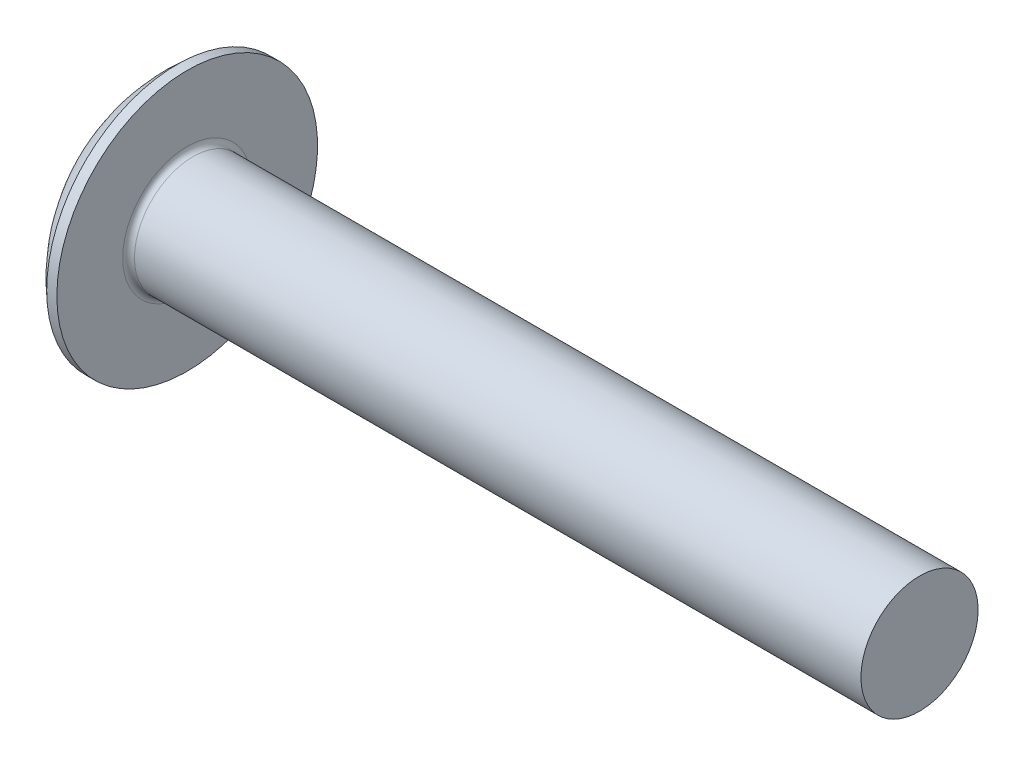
from build123d import *

# Parameters (mm, degrees)
FILLET1_R    = 0.4
RECPAT_COUNT = 2
RECPAT_ANGLE = 90


with BuildPart() as part:
    # BodySke → BaseBody (revolve)
    with BuildSketch(Plane.XY, mode=Mode.PRIVATE) as basebody_sk:
        with BuildLine():
            Line((4.8, 4), (4.8, 8.9))
            Line((4.8, 8.9), (4.105264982, 8.9))
            ThreePointArc((4.105264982, 8.9), (1.075772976, 4.900591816), (0, 0))
            Line((0, 0), (54.8, 0))
            Line((54.8, 0), (54.8, 4))
            Line((54.8, 4), (4.8, 4))
        make_face()
    revolve(basebody_sk.sketch.rotate(Axis((0, 0, 0), (1, 0, 0)), 90), axis=Axis((0, 0, 0), (1, 0, 0)))

    # Fillet1
    fillet1_edges = [part.edges().sort_by_distance(p)[0] for p in [
        (4.8, 0, -4),
    ]]
    fillet(fillet1_edges, radius=FILLET1_R)

    # RecSkeTop → Recess section 0
    with BuildSketch(Plane(origin=(0, 0, 0), x_dir=(0, 0, -1), z_dir=(1, 0, 0))):
        with BuildLine():
            Line((-0.858, 3.9), (0.858, 3.9))
            Line((0.858, 3.9), (0.858, -3.9))
            Line((0.858, -3.9), (-0.858, -3.9))
            Line((-0.858, -3.9), (-0.858, 3.9))
        make_face()
    # RecSkeBot → Recess section 1
    with BuildSketch(Plane(origin=(4.36, 0, 0), x_dir=(0, 0, -1), z_dir=(1, 0, 0))):
        with BuildLine():
            Line((-0.858, 1.726184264), (0.858, 1.726184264))
            Line((0.858, 1.726184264), (0.858, -1.726184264))
            Line((0.858, -1.726184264), (-0.858, -1.726184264))
            Line((-0.858, -1.726184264), (-0.858, 1.726184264))
        make_face()
    recess = loft(mode=Mode.SUBTRACT)

    # RecPat: Recess ×2 about axis
    recpat_axis = Axis((0, 0, 0), (1, 0, 0))
    for i in range(1, RECPAT_COUNT):
        add(recess.rotate(recpat_axis, i * RECPAT_ANGLE / (RECPAT_COUNT - 1)), mode=Mode.SUBTRACT)

    # RecCorSke → RecessCore (revolve, cut)
    with BuildSketch(Plane.XY, mode=Mode.PRIVATE) as recesscore_sk:
        Polygon((0, 0), (0, 1.8876), (4.36, 1.5827191), (4.874256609, 0), align=None)
    revolve(recesscore_sk.sketch.rotate(Axis((0, 0, 0), (1, 0, 0)), 346.596100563), axis=Axis((0, 0, 0), (1, 0, 0)), mode=Mode.SUBTRACT)


solid = part.part
